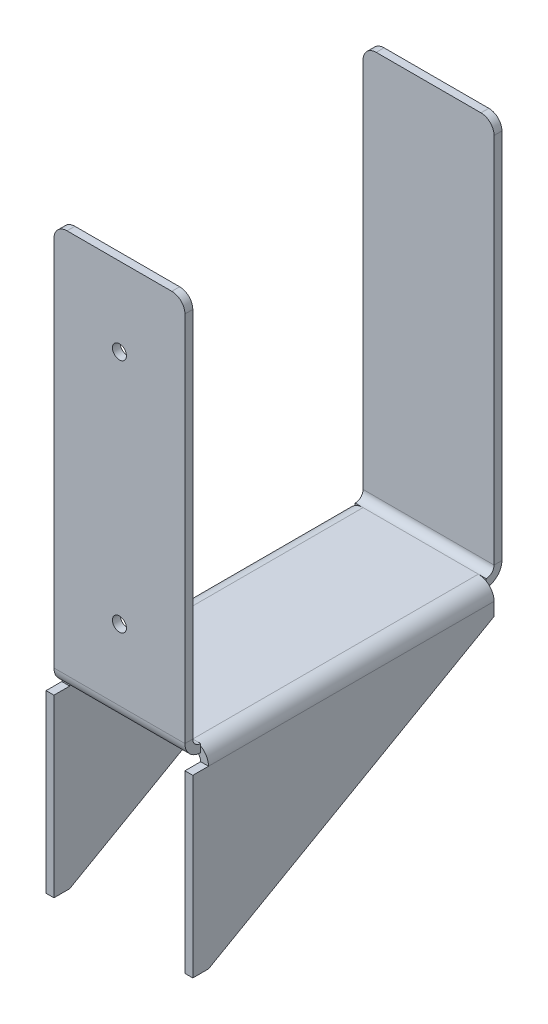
ISO-10303-21;
HEADER;
FILE_DESCRIPTION(('STEP AP214'),'2;1');
FILE_NAME('part.step','',(''),(''),'','','');
FILE_SCHEMA(('AUTOMOTIVE_DESIGN { 1 0 10303 214 1 1 1 1 }'));
ENDSEC;
DATA;
#1=APPLICATION_CONTEXT('core data for automotive mechanical design processes');
#2=APPLICATION_PROTOCOL_DEFINITION('international standard','automotive_design',2000,#1);
#3=PRODUCT_CONTEXT('',#1,'mechanical');
#4=PRODUCT('Part','Part','',(#3));
#5=PRODUCT_RELATED_PRODUCT_CATEGORY('part','',(#4));
#6=PRODUCT_DEFINITION_FORMATION('','',#4);
#7=PRODUCT_DEFINITION_CONTEXT('part definition',#1,'design');
#8=PRODUCT_DEFINITION('design','',#6,#7);
#9=PRODUCT_DEFINITION_SHAPE('','',#8);
#10=(LENGTH_UNIT() NAMED_UNIT(*) SI_UNIT(.MILLI.,.METRE.));
#11=(NAMED_UNIT(*) PLANE_ANGLE_UNIT() SI_UNIT($,.RADIAN.));
#12=(NAMED_UNIT(*) SI_UNIT($,.STERADIAN.) SOLID_ANGLE_UNIT());
#13=UNCERTAINTY_MEASURE_WITH_UNIT(LENGTH_MEASURE(1.E-05),#10,'distance_accuracy_value','');
#14=(GEOMETRIC_REPRESENTATION_CONTEXT(3) GLOBAL_UNCERTAINTY_ASSIGNED_CONTEXT((#13)) GLOBAL_UNIT_ASSIGNED_CONTEXT((#10,
#11,#12)) REPRESENTATION_CONTEXT('',''));
#15=CARTESIAN_POINT('',(0.,0.,0.));
#16=DIRECTION('',(0.,0.,1.));
#17=DIRECTION('',(1.,0.,0.));
#18=AXIS2_PLACEMENT_3D('',#15,#16,#17);
#19=CARTESIAN_POINT('',(53.,-3.00000000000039,-112.));
#20=DIRECTION('',(0.,0.,1.));
#21=DIRECTION('',(0.,-1.,0.));
#22=AXIS2_PLACEMENT_3D('',#19,#20,#21);
#23=PLANE('',#22);
#24=DIRECTION('',(-1.,0.,0.));
#25=VECTOR('',#24,1.);
#26=CARTESIAN_POINT('',(50.0000000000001,-11.0000000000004,-112.));
#27=LINE('',#26,#25);
#28=CARTESIAN_POINT('',(50.0000000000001,-11.0000000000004,-112.));
#29=VERTEX_POINT('',#28);
#30=CARTESIAN_POINT('',(53.,-11.0000000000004,-112.));
#31=VERTEX_POINT('',#30);
#32=EDGE_CURVE('E260',#29,#31,#27,.F.);
#33=ORIENTED_EDGE('',*,*,#32,.F.);
#34=DIRECTION('',(0.,1.,0.));
#35=VECTOR('',#34,1.);
#36=CARTESIAN_POINT('',(50.,-3.0000000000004,-112.));
#37=LINE('',#36,#35);
#38=CARTESIAN_POINT('',(50.,-6.00000000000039,-112.));
#39=VERTEX_POINT('',#38);
#40=EDGE_CURVE('E287',#29,#39,#37,.T.);
#41=ORIENTED_EDGE('',*,*,#40,.T.);
#42=DIRECTION('',(1.,0.,0.));
#43=VECTOR('',#42,1.);
#44=CARTESIAN_POINT('',(50.,-6.00000000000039,-112.));
#45=LINE('',#44,#43);
#46=CARTESIAN_POINT('',(53.,-6.00000000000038,-112.));
#47=VERTEX_POINT('',#46);
#48=EDGE_CURVE('E281',#39,#47,#45,.T.);
#49=ORIENTED_EDGE('',*,*,#48,.T.);
#50=DIRECTION('',(0.,1.,0.));
#51=VECTOR('',#50,1.);
#52=CARTESIAN_POINT('',(53.,-3.00000000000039,-112.));
#53=LINE('',#52,#51);
#54=EDGE_CURVE('E274',#31,#47,#53,.T.);
#55=ORIENTED_EDGE('',*,*,#54,.F.);
#56=EDGE_LOOP('',(#33,#41,#49,#55));
#57=FACE_BOUND('',#56,.T.);
#58=ADVANCED_FACE('F38',(#57),#23,.F.);
#59=CARTESIAN_POINT('',(53.0000000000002,-73.0000000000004,-112.));
#60=DIRECTION('',(-1.,0.,0.));
#61=DIRECTION('',(0.,-1.,0.));
#62=AXIS2_PLACEMENT_3D('',#59,#60,#61);
#63=PLANE('',#62);
#64=DIRECTION('',(0.,0.494420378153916,-0.869222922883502));
#65=VECTOR('',#64,1.);
#66=CARTESIAN_POINT('',(53.0000000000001,-26.1559936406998,-85.3547853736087));
#67=LINE('',#66,#65);
#68=CARTESIAN_POINT('',(53.0000000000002,-73.,-3.00000000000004));
#69=VERTEX_POINT('',#68);
#70=EDGE_CURVE('E56',#69,#31,#67,.T.);
#71=ORIENTED_EDGE('',*,*,#70,.T.);
#72=ORIENTED_EDGE('',*,*,#54,.T.);
#73=DIRECTION('',(0.,0.,-1.));
#74=VECTOR('',#73,1.);
#75=CARTESIAN_POINT('',(53.,-6.00000000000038,-112.));
#76=LINE('',#75,#74);
#77=CARTESIAN_POINT('',(53.0000000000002,-5.99999999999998,-2.99999999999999));
#78=VERTEX_POINT('',#77);
#79=EDGE_CURVE('E290',#78,#47,#76,.T.);
#80=ORIENTED_EDGE('',*,*,#79,.F.);
#81=DIRECTION('',(0.,0.,-1.));
#82=VECTOR('',#81,1.);
#83=CARTESIAN_POINT('',(53.0000000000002,-5.99999999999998,3.00000000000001));
#84=LINE('',#83,#82);
#85=CARTESIAN_POINT('',(53.0000000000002,-5.99999999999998,3.00000000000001));
#86=VERTEX_POINT('',#85);
#87=EDGE_CURVE('E589',#86,#78,#84,.T.);
#88=ORIENTED_EDGE('',*,*,#87,.F.);
#89=DIRECTION('',(0.,1.,0.));
#90=VECTOR('',#89,1.);
#91=CARTESIAN_POINT('',(53.0000000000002,-73.,3.00000000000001));
#92=LINE('',#91,#90);
#93=CARTESIAN_POINT('',(53.0000000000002,-73.,3.00000000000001));
#94=VERTEX_POINT('',#93);
#95=EDGE_CURVE('E595',#94,#86,#92,.T.);
#96=ORIENTED_EDGE('',*,*,#95,.F.);
#97=DIRECTION('',(0.,0.,-1.));
#98=VECTOR('',#97,1.);
#99=CARTESIAN_POINT('',(53.0000000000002,-73.0000000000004,-112.));
#100=LINE('',#99,#98);
#101=EDGE_CURVE('E277',#94,#69,#100,.T.);
#102=ORIENTED_EDGE('',*,*,#101,.T.);
#103=EDGE_LOOP('',(#71,#72,#80,#88,#96,#102));
#104=FACE_BOUND('',#103,.T.);
#105=ADVANCED_FACE('F272',(#104),#63,.F.);
#106=CARTESIAN_POINT('',(50.0000000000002,-73.0000000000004,-112.));
#107=DIRECTION('',(-1.,0.,0.));
#108=DIRECTION('',(0.,-1.,0.));
#109=AXIS2_PLACEMENT_3D('',#106,#107,#108);
#110=PLANE('',#109);
#111=ORIENTED_EDGE('',*,*,#40,.F.);
#112=DIRECTION('',(0.,0.494420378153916,-0.869222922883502));
#113=VECTOR('',#112,1.);
#114=CARTESIAN_POINT('',(50.0000000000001,-26.1559936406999,-85.3547853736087));
#115=LINE('',#114,#113);
#116=CARTESIAN_POINT('',(50.0000000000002,-73.,-3.00000000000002));
#117=VERTEX_POINT('',#116);
#118=EDGE_CURVE('E263',#117,#29,#115,.T.);
#119=ORIENTED_EDGE('',*,*,#118,.F.);
#120=DIRECTION('',(0.,0.,-1.));
#121=VECTOR('',#120,1.);
#122=CARTESIAN_POINT('',(50.0000000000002,-73.0000000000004,-112.));
#123=LINE('',#122,#121);
#124=CARTESIAN_POINT('',(50.,-73.,3.00000000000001));
#125=VERTEX_POINT('',#124);
#126=EDGE_CURVE('E282',#125,#117,#123,.T.);
#127=ORIENTED_EDGE('',*,*,#126,.F.);
#128=DIRECTION('',(0.,-1.,0.));
#129=VECTOR('',#128,1.);
#130=CARTESIAN_POINT('',(50.,-5.99999999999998,3.00000000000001));
#131=LINE('',#130,#129);
#132=CARTESIAN_POINT('',(50.,-5.99999999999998,3.00000000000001));
#133=VERTEX_POINT('',#132);
#134=EDGE_CURVE('E600',#133,#125,#131,.T.);
#135=ORIENTED_EDGE('',*,*,#134,.F.);
#136=DIRECTION('',(0.,0.,-1.));
#137=VECTOR('',#136,1.);
#138=CARTESIAN_POINT('',(50.,-5.99999999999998,3.00000000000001));
#139=LINE('',#138,#137);
#140=CARTESIAN_POINT('',(50.,-5.99999999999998,-2.99999999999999));
#141=VERTEX_POINT('',#140);
#142=EDGE_CURVE('E591',#133,#141,#139,.T.);
#143=ORIENTED_EDGE('',*,*,#142,.T.);
#144=DIRECTION('',(0.,0.,1.));
#145=VECTOR('',#144,1.);
#146=CARTESIAN_POINT('',(50.,-6.00000000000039,-112.));
#147=LINE('',#146,#145);
#148=EDGE_CURVE('E528',#39,#141,#147,.T.);
#149=ORIENTED_EDGE('',*,*,#148,.F.);
#150=EDGE_LOOP('',(#111,#119,#127,#135,#143,#149));
#151=FACE_BOUND('',#150,.T.);
#152=ADVANCED_FACE('F614',(#151),#110,.T.);
#153=CARTESIAN_POINT('',(53.0000000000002,-73.0000000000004,-112.));
#154=DIRECTION('',(0.,1.,0.));
#155=DIRECTION('',(0.,0.,1.));
#156=AXIS2_PLACEMENT_3D('',#153,#154,#155);
#157=PLANE('',#156);
#158=DIRECTION('',(-1.,0.,0.));
#159=VECTOR('',#158,1.);
#160=CARTESIAN_POINT('',(50.0000000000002,-73.,-3.00000000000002));
#161=LINE('',#160,#159);
#162=EDGE_CURVE('E268',#117,#69,#161,.F.);
#163=ORIENTED_EDGE('',*,*,#162,.T.);
#164=ORIENTED_EDGE('',*,*,#101,.F.);
#165=DIRECTION('',(1.,0.,0.));
#166=VECTOR('',#165,1.);
#167=CARTESIAN_POINT('',(50.,-73.,3.00000000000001));
#168=LINE('',#167,#166);
#169=EDGE_CURVE('E597',#125,#94,#168,.T.);
#170=ORIENTED_EDGE('',*,*,#169,.F.);
#171=ORIENTED_EDGE('',*,*,#126,.T.);
#172=EDGE_LOOP('',(#163,#164,#170,#171));
#173=FACE_BOUND('',#172,.T.);
#174=ADVANCED_FACE('F612',(#173),#157,.F.);
#175=CARTESIAN_POINT('',(-3.00000000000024,-73.0000000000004,-112.));
#176=DIRECTION('',(0.,0.,1.));
#177=DIRECTION('',(0.,-1.,0.));
#178=AXIS2_PLACEMENT_3D('',#175,#176,#177);
#179=PLANE('',#178);
#180=DIRECTION('',(-1.,0.,0.));
#181=VECTOR('',#180,1.);
#182=CARTESIAN_POINT('',(-3.00000000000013,-11.0000000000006,-112.));
#183=LINE('',#182,#181);
#184=CARTESIAN_POINT('',(-3.00000000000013,-11.0000000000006,-112.));
#185=VERTEX_POINT('',#184);
#186=CARTESIAN_POINT('',(0.,-11.0000000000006,-112.));
#187=VERTEX_POINT('',#186);
#188=EDGE_CURVE('E604',#185,#187,#183,.F.);
#189=ORIENTED_EDGE('',*,*,#188,.F.);
#190=DIRECTION('',(0.,-1.,0.));
#191=VECTOR('',#190,1.);
#192=CARTESIAN_POINT('',(-3.00000000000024,-73.0000000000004,-112.));
#193=LINE('',#192,#191);
#194=CARTESIAN_POINT('',(-3.00000000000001,-6.00000000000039,-112.));
#195=VERTEX_POINT('',#194);
#196=EDGE_CURVE('E555',#195,#185,#193,.T.);
#197=ORIENTED_EDGE('',*,*,#196,.F.);
#198=DIRECTION('',(-1.,0.,0.));
#199=VECTOR('',#198,1.);
#200=CARTESIAN_POINT('',(0.,-6.00000000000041,-112.));
#201=LINE('',#200,#199);
#202=CARTESIAN_POINT('',(0.,-6.00000000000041,-112.));
#203=VERTEX_POINT('',#202);
#204=EDGE_CURVE('E565',#203,#195,#201,.T.);
#205=ORIENTED_EDGE('',*,*,#204,.F.);
#206=DIRECTION('',(0.,-1.,0.));
#207=VECTOR('',#206,1.);
#208=CARTESIAN_POINT('',(-2.3746494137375E-13,-73.0000000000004,-112.));
#209=LINE('',#208,#207);
#210=EDGE_CURVE('E556',#203,#187,#209,.T.);
#211=ORIENTED_EDGE('',*,*,#210,.T.);
#212=EDGE_LOOP('',(#189,#197,#205,#211));
#213=FACE_BOUND('',#212,.T.);
#214=ADVANCED_FACE('F809',(#213),#179,.F.);
#215=CARTESIAN_POINT('',(-3.00000000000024,-73.,-2.99999999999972));
#216=DIRECTION('',(1.,0.,0.));
#217=DIRECTION('',(0.,1.,0.));
#218=AXIS2_PLACEMENT_3D('',#215,#216,#217);
#219=PLANE('',#218);
#220=DIRECTION('',(0.,-0.494420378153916,0.869222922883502));
#221=VECTOR('',#220,1.);
#222=CARTESIAN_POINT('',(-3.00000000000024,-73.0000000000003,-2.99999999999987));
#223=LINE('',#222,#221);
#224=CARTESIAN_POINT('',(-3.00000000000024,-73.,-3.00000000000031));
#225=VERTEX_POINT('',#224);
#226=EDGE_CURVE('E267',#185,#225,#223,.T.);
#227=ORIENTED_EDGE('',*,*,#226,.T.);
#228=DIRECTION('',(0.,0.,1.));
#229=VECTOR('',#228,1.);
#230=CARTESIAN_POINT('',(-3.00000000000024,-73.,-2.99999999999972));
#231=LINE('',#230,#229);
#232=CARTESIAN_POINT('',(-3.00000000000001,-73.,3.00000000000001));
#233=VERTEX_POINT('',#232);
#234=EDGE_CURVE('E540',#225,#233,#231,.T.);
#235=ORIENTED_EDGE('',*,*,#234,.T.);
#236=DIRECTION('',(0.,-1.,0.));
#237=VECTOR('',#236,1.);
#238=CARTESIAN_POINT('',(-3.00000000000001,-5.99999999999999,3.00000000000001));
#239=LINE('',#238,#237);
#240=CARTESIAN_POINT('',(-3.00000000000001,-5.99999999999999,3.00000000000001));
#241=VERTEX_POINT('',#240);
#242=EDGE_CURVE('E586',#241,#233,#239,.T.);
#243=ORIENTED_EDGE('',*,*,#242,.F.);
#244=DIRECTION('',(0.,0.,-1.));
#245=VECTOR('',#244,1.);
#246=CARTESIAN_POINT('',(-3.00000000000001,-5.99999999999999,3.00000000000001));
#247=LINE('',#246,#245);
#248=CARTESIAN_POINT('',(-3.00000000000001,-5.99999999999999,-2.99999999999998));
#249=VERTEX_POINT('',#248);
#250=EDGE_CURVE('E576',#241,#249,#247,.T.);
#251=ORIENTED_EDGE('',*,*,#250,.T.);
#252=DIRECTION('',(0.,0.,1.));
#253=VECTOR('',#252,1.);
#254=CARTESIAN_POINT('',(-3.00000000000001,-5.99999999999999,-2.99999999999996));
#255=LINE('',#254,#253);
#256=EDGE_CURVE('E559',#195,#249,#255,.T.);
#257=ORIENTED_EDGE('',*,*,#256,.F.);
#258=ORIENTED_EDGE('',*,*,#196,.T.);
#259=EDGE_LOOP('',(#227,#235,#243,#251,#257,#258));
#260=FACE_BOUND('',#259,.T.);
#261=ADVANCED_FACE('F823',(#260),#219,.F.);
#262=CARTESIAN_POINT('',(-2.44403835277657E-13,-73.,-2.99999999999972));
#263=DIRECTION('',(1.,0.,0.));
#264=DIRECTION('',(0.,1.,0.));
#265=AXIS2_PLACEMENT_3D('',#262,#263,#264);
#266=PLANE('',#265);
#267=DIRECTION('',(0.,0.,1.));
#268=VECTOR('',#267,1.);
#269=CARTESIAN_POINT('',(-2.44403835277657E-13,-73.,-2.99999999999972));
#270=LINE('',#269,#268);
#271=CARTESIAN_POINT('',(-2.44403835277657E-13,-73.,-3.00000000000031));
#272=VERTEX_POINT('',#271);
#273=CARTESIAN_POINT('',(-2.44403835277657E-13,-73.,3.00000000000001));
#274=VERTEX_POINT('',#273);
#275=EDGE_CURVE('E553',#272,#274,#270,.T.);
#276=ORIENTED_EDGE('',*,*,#275,.F.);
#277=DIRECTION('',(0.,-0.494420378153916,0.869222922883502));
#278=VECTOR('',#277,1.);
#279=CARTESIAN_POINT('',(-2.4459601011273E-13,-73.0000000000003,-2.99999999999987));
#280=LINE('',#279,#278);
#281=EDGE_CURVE('E64',#187,#272,#280,.T.);
#282=ORIENTED_EDGE('',*,*,#281,.F.);
#283=ORIENTED_EDGE('',*,*,#210,.F.);
#284=DIRECTION('',(0.,0.,-1.));
#285=VECTOR('',#284,1.);
#286=CARTESIAN_POINT('',(0.,-6.,-2.99999999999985));
#287=LINE('',#286,#285);
#288=CARTESIAN_POINT('',(0.,-6.,-2.99999999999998));
#289=VERTEX_POINT('',#288);
#290=EDGE_CURVE('E569',#289,#203,#287,.T.);
#291=ORIENTED_EDGE('',*,*,#290,.F.);
#292=DIRECTION('',(0.,0.,-1.));
#293=VECTOR('',#292,1.);
#294=CARTESIAN_POINT('',(-2.44403835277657E-13,-5.99999999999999,3.00000000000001));
#295=LINE('',#294,#293);
#296=CARTESIAN_POINT('',(-2.44403835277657E-13,-5.99999999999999,3.00000000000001));
#297=VERTEX_POINT('',#296);
#298=EDGE_CURVE('E570',#297,#289,#295,.T.);
#299=ORIENTED_EDGE('',*,*,#298,.F.);
#300=DIRECTION('',(0.,1.,0.));
#301=VECTOR('',#300,1.);
#302=CARTESIAN_POINT('',(-2.44403835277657E-13,-73.,3.00000000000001));
#303=LINE('',#302,#301);
#304=EDGE_CURVE('E581',#274,#297,#303,.T.);
#305=ORIENTED_EDGE('',*,*,#304,.F.);
#306=EDGE_LOOP('',(#276,#282,#283,#291,#299,#305));
#307=FACE_BOUND('',#306,.T.);
#308=ADVANCED_FACE('F812',(#307),#266,.T.);
#309=CARTESIAN_POINT('',(-3.00000000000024,-73.,-2.99999999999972));
#310=DIRECTION('',(0.,1.,0.));
#311=DIRECTION('',(0.,0.,1.));
#312=AXIS2_PLACEMENT_3D('',#309,#310,#311);
#313=PLANE('',#312);
#314=DIRECTION('',(-1.,0.,0.));
#315=VECTOR('',#314,1.);
#316=CARTESIAN_POINT('',(-3.00000000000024,-73.,-3.00000000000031));
#317=LINE('',#316,#315);
#318=EDGE_CURVE('E603',#225,#272,#317,.F.);
#319=ORIENTED_EDGE('',*,*,#318,.T.);
#320=ORIENTED_EDGE('',*,*,#275,.T.);
#321=DIRECTION('',(1.,0.,0.));
#322=VECTOR('',#321,1.);
#323=CARTESIAN_POINT('',(-3.00000000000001,-73.,3.00000000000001));
#324=LINE('',#323,#322);
#325=EDGE_CURVE('E583',#233,#274,#324,.T.);
#326=ORIENTED_EDGE('',*,*,#325,.F.);
#327=ORIENTED_EDGE('',*,*,#234,.F.);
#328=EDGE_LOOP('',(#319,#320,#326,#327));
#329=FACE_BOUND('',#328,.T.);
#330=ADVANCED_FACE('F671',(#329),#313,.F.);
#331=CARTESIAN_POINT('',(0.,-3.00000000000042,-112.));
#332=DIRECTION('',(0.,0.,1.));
#333=DIRECTION('',(1.,0.,0.));
#334=AXIS2_PLACEMENT_3D('',#331,#332,#333);
#335=PLANE('',#334);
#336=DIRECTION('',(0.,-1.,0.));
#337=VECTOR('',#336,1.);
#338=CARTESIAN_POINT('',(0.,-4.22838847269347E-13,-112.));
#339=LINE('',#338,#337);
#340=CARTESIAN_POINT('',(0.,-4.23272528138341E-13,-112.));
#341=VERTEX_POINT('',#340);
#342=CARTESIAN_POINT('',(0.,-0.803847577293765,-112.));
#343=VERTEX_POINT('',#342);
#344=EDGE_CURVE('E377',#341,#343,#339,.T.);
#345=ORIENTED_EDGE('',*,*,#344,.T.);
#346=CARTESIAN_POINT('',(3.00000000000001,-6.00000000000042,-112.));
#347=DIRECTION('',(0.,0.,-1.));
#348=DIRECTION('',(0.,1.,0.));
#349=AXIS2_PLACEMENT_3D('',#346,#347,#348);
#350=CIRCLE('',#349,6.00000000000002);
#351=CARTESIAN_POINT('',(3.00000000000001,-3.98986399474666E-13,-112.));
#352=VERTEX_POINT('',#351);
#353=EDGE_CURVE('E11',#343,#352,#350,.T.);
#354=ORIENTED_EDGE('',*,*,#353,.T.);
#355=DIRECTION('',(-1.,0.,0.));
#356=VECTOR('',#355,1.);
#357=CARTESIAN_POINT('',(0.,-4.22838847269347E-13,-112.));
#358=LINE('',#357,#356);
#359=EDGE_CURVE('E365',#341,#352,#358,.F.);
#360=ORIENTED_EDGE('',*,*,#359,.F.);
#361=EDGE_LOOP('',(#345,#354,#360));
#362=FACE_BOUND('',#361,.T.);
#363=ADVANCED_FACE('F667',(#362),#335,.T.);
#364=CARTESIAN_POINT('',(3.00000000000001,-2.99999999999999,-2.99999999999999));
#365=DIRECTION('',(0.,0.,-1.));
#366=DIRECTION('',(0.,1.,0.));
#367=AXIS2_PLACEMENT_3D('',#364,#365,#366);
#368=PLANE('',#367);
#369=DIRECTION('',(-1.,0.,0.));
#370=VECTOR('',#369,1.);
#371=CARTESIAN_POINT('',(50.,0.,-2.99999999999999));
#372=LINE('',#371,#370);
#373=CARTESIAN_POINT('',(3.00000000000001,0.,-3.));
#374=VERTEX_POINT('',#373);
#375=CARTESIAN_POINT('',(0.,0.,-2.99999999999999));
#376=VERTEX_POINT('',#375);
#377=EDGE_CURVE('E385',#374,#376,#372,.T.);
#378=ORIENTED_EDGE('',*,*,#377,.F.);
#379=CARTESIAN_POINT('',(3.00000000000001,-6.00000000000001,-2.99999999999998));
#380=DIRECTION('',(0.,0.,-1.));
#381=DIRECTION('',(0.,1.,0.));
#382=AXIS2_PLACEMENT_3D('',#379,#380,#381);
#383=CIRCLE('',#382,6.00000000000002);
#384=CARTESIAN_POINT('',(0.,-0.80384757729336,-2.99999999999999));
#385=VERTEX_POINT('',#384);
#386=EDGE_CURVE('E534',#374,#385,#383,.F.);
#387=ORIENTED_EDGE('',*,*,#386,.T.);
#388=DIRECTION('',(0.,-1.,0.));
#389=VECTOR('',#388,1.);
#390=CARTESIAN_POINT('',(0.,0.,-2.99999999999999));
#391=LINE('',#390,#389);
#392=EDGE_CURVE('E386',#376,#385,#391,.T.);
#393=ORIENTED_EDGE('',*,*,#392,.F.);
#394=EDGE_LOOP('',(#378,#387,#393));
#395=FACE_BOUND('',#394,.T.);
#396=ADVANCED_FACE('F663',(#395),#368,.T.);
#397=CARTESIAN_POINT('',(47.,-3.00000000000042,-112.));
#398=DIRECTION('',(0.,0.,1.));
#399=DIRECTION('',(1.,0.,0.));
#400=AXIS2_PLACEMENT_3D('',#397,#398,#399);
#401=PLANE('',#400);
#402=CARTESIAN_POINT('',(47.,-4.23272528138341E-13,-112.));
#403=VERTEX_POINT('',#402);
#404=CARTESIAN_POINT('',(50.,-4.22838847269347E-13,-112.));
#405=VERTEX_POINT('',#404);
#406=EDGE_CURVE('E369',#403,#405,#358,.F.);
#407=ORIENTED_EDGE('',*,*,#406,.F.);
#408=CARTESIAN_POINT('',(47.,-6.0000000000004,-112.));
#409=DIRECTION('',(0.,0.,1.));
#410=DIRECTION('',(0.,-1.,0.));
#411=AXIS2_PLACEMENT_3D('',#408,#409,#410);
#412=CIRCLE('',#411,5.99999999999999);
#413=CARTESIAN_POINT('',(50.,-0.803847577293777,-112.));
#414=VERTEX_POINT('',#413);
#415=EDGE_CURVE('E299',#403,#414,#412,.F.);
#416=ORIENTED_EDGE('',*,*,#415,.T.);
#417=DIRECTION('',(0.,-1.,0.));
#418=VECTOR('',#417,1.);
#419=CARTESIAN_POINT('',(50.,-4.22838847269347E-13,-112.));
#420=LINE('',#419,#418);
#421=EDGE_CURVE('E372',#405,#414,#420,.T.);
#422=ORIENTED_EDGE('',*,*,#421,.F.);
#423=EDGE_LOOP('',(#407,#416,#422));
#424=FACE_BOUND('',#423,.T.);
#425=ADVANCED_FACE('F666',(#424),#401,.T.);
#426=CARTESIAN_POINT('',(50.,-3.00000000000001,-2.99999999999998));
#427=DIRECTION('',(0.,0.,-1.));
#428=DIRECTION('',(-1.,0.,0.));
#429=AXIS2_PLACEMENT_3D('',#426,#427,#428);
#430=PLANE('',#429);
#431=DIRECTION('',(0.,-1.,0.));
#432=VECTOR('',#431,1.);
#433=CARTESIAN_POINT('',(50.,0.,-2.99999999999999));
#434=LINE('',#433,#432);
#435=CARTESIAN_POINT('',(50.,0.,-2.99999999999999));
#436=VERTEX_POINT('',#435);
#437=CARTESIAN_POINT('',(50.,-0.803847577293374,-2.99999999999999));
#438=VERTEX_POINT('',#437);
#439=EDGE_CURVE('E390',#436,#438,#434,.T.);
#440=ORIENTED_EDGE('',*,*,#439,.T.);
#441=CARTESIAN_POINT('',(47.,-5.99999999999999,-2.99999999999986));
#442=DIRECTION('',(0.,0.,1.));
#443=DIRECTION('',(0.,-1.,0.));
#444=AXIS2_PLACEMENT_3D('',#441,#442,#443);
#445=CIRCLE('',#444,5.99999999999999);
#446=CARTESIAN_POINT('',(47.,0.,-2.99999999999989));
#447=VERTEX_POINT('',#446);
#448=EDGE_CURVE('E47',#438,#447,#445,.T.);
#449=ORIENTED_EDGE('',*,*,#448,.T.);
#450=EDGE_CURVE('E380',#436,#447,#372,.T.);
#451=ORIENTED_EDGE('',*,*,#450,.F.);
#452=EDGE_LOOP('',(#440,#449,#451));
#453=FACE_BOUND('',#452,.T.);
#454=ADVANCED_FACE('F675',(#453),#430,.T.);
#455=CARTESIAN_POINT('',(0.,-3.,0.));
#456=DIRECTION('',(0.,1.,0.));
#457=DIRECTION('',(0.,0.,1.));
#458=AXIS2_PLACEMENT_3D('',#455,#456,#457);
#459=PLANE('',#458);
#460=DIRECTION('',(0.,0.,-1.));
#461=VECTOR('',#460,1.);
#462=CARTESIAN_POINT('',(3.00000000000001,-3.0000000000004,-112.));
#463=LINE('',#462,#461);
#464=CARTESIAN_POINT('',(3.00000000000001,-3.0000000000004,-112.));
#465=VERTEX_POINT('',#464);
#466=CARTESIAN_POINT('',(3.00000000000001,-2.99999999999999,-2.99999999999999));
#467=VERTEX_POINT('',#466);
#468=EDGE_CURVE('E539',#465,#467,#463,.F.);
#469=ORIENTED_EDGE('',*,*,#468,.F.);
#470=DIRECTION('',(-1.,0.,0.));
#471=VECTOR('',#470,1.);
#472=CARTESIAN_POINT('',(0.,-3.00000000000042,-112.));
#473=LINE('',#472,#471);
#474=CARTESIAN_POINT('',(47.,-3.00000000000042,-112.));
#475=VERTEX_POINT('',#474);
#476=EDGE_CURVE('E355',#465,#475,#473,.F.);
#477=ORIENTED_EDGE('',*,*,#476,.T.);
#478=DIRECTION('',(0.,0.,1.));
#479=VECTOR('',#478,1.);
#480=CARTESIAN_POINT('',(47.,-3.00000000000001,-2.99999999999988));
#481=LINE('',#480,#479);
#482=CARTESIAN_POINT('',(47.,-3.00000000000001,-2.99999999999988));
#483=VERTEX_POINT('',#482);
#484=EDGE_CURVE('E307',#483,#475,#481,.F.);
#485=ORIENTED_EDGE('',*,*,#484,.F.);
#486=DIRECTION('',(1.,0.,0.));
#487=VECTOR('',#486,1.);
#488=CARTESIAN_POINT('',(0.,-3.00000000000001,-2.99999999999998));
#489=LINE('',#488,#487);
#490=EDGE_CURVE('E389',#467,#483,#489,.T.);
#491=ORIENTED_EDGE('',*,*,#490,.F.);
#492=EDGE_LOOP('',(#469,#477,#485,#491));
#493=FACE_BOUND('',#492,.T.);
#494=ADVANCED_FACE('F679',(#493),#459,.F.);
#495=CARTESIAN_POINT('',(0.,0.,0.));
#496=DIRECTION('',(0.,1.,0.));
#497=DIRECTION('',(0.,0.,1.));
#498=AXIS2_PLACEMENT_3D('',#495,#496,#497);
#499=PLANE('',#498);
#500=EDGE_CURVE('E368',#352,#403,#358,.F.);
#501=ORIENTED_EDGE('',*,*,#500,.F.);
#502=DIRECTION('',(0.,0.,-1.));
#503=VECTOR('',#502,1.);
#504=CARTESIAN_POINT('',(3.00000000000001,-3.98986399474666E-13,-112.));
#505=LINE('',#504,#503);
#506=EDGE_CURVE('E547',#352,#374,#505,.F.);
#507=ORIENTED_EDGE('',*,*,#506,.T.);
#508=EDGE_CURVE('E384',#447,#374,#372,.T.);
#509=ORIENTED_EDGE('',*,*,#508,.F.);
#510=DIRECTION('',(0.,0.,1.));
#511=VECTOR('',#510,1.);
#512=CARTESIAN_POINT('',(47.,0.,-2.99999999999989));
#513=LINE('',#512,#511);
#514=EDGE_CURVE('E294',#447,#403,#513,.F.);
#515=ORIENTED_EDGE('',*,*,#514,.T.);
#516=EDGE_LOOP('',(#501,#507,#509,#515));
#517=FACE_BOUND('',#516,.T.);
#518=ADVANCED_FACE('F725',(#517),#499,.T.);
#519=CARTESIAN_POINT('',(0.,0.,3.));
#520=DIRECTION('',(1.,0.,0.));
#521=DIRECTION('',(0.,0.,-1.));
#522=AXIS2_PLACEMENT_3D('',#519,#520,#521);
#523=PLANE('',#522);
#524=DIRECTION('',(0.,-1.,0.));
#525=VECTOR('',#524,1.);
#526=CARTESIAN_POINT('',(0.,0.,3.));
#527=LINE('',#526,#525);
#528=CARTESIAN_POINT('',(0.,145.,3.));
#529=VERTEX_POINT('',#528);
#530=CARTESIAN_POINT('',(0.,2.99999999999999,3.));
#531=VERTEX_POINT('',#530);
#532=EDGE_CURVE('E420',#529,#531,#527,.T.);
#533=ORIENTED_EDGE('',*,*,#532,.F.);
#534=DIRECTION('',(0.,0.,-1.));
#535=VECTOR('',#534,1.);
#536=CARTESIAN_POINT('',(0.,145.,3.));
#537=LINE('',#536,#535);
#538=CARTESIAN_POINT('',(0.,145.,0.));
#539=VERTEX_POINT('',#538);
#540=EDGE_CURVE('E429',#529,#539,#537,.T.);
#541=ORIENTED_EDGE('',*,*,#540,.T.);
#542=DIRECTION('',(0.,-1.,0.));
#543=VECTOR('',#542,1.);
#544=CARTESIAN_POINT('',(0.,0.,0.));
#545=LINE('',#544,#543);
#546=CARTESIAN_POINT('',(0.,3.,0.));
#547=VERTEX_POINT('',#546);
#548=EDGE_CURVE('E417',#539,#547,#545,.T.);
#549=ORIENTED_EDGE('',*,*,#548,.T.);
#550=DIRECTION('',(0.,0.,1.));
#551=VECTOR('',#550,1.);
#552=CARTESIAN_POINT('',(0.,2.99999999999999,0.));
#553=LINE('',#552,#551);
#554=EDGE_CURVE('E403',#547,#531,#553,.T.);
#555=ORIENTED_EDGE('',*,*,#554,.T.);
#556=EDGE_LOOP('',(#533,#541,#549,#555));
#557=FACE_BOUND('',#556,.T.);
#558=ADVANCED_FACE('F490',(#557),#523,.F.);
#559=CARTESIAN_POINT('',(50.,0.,3.));
#560=DIRECTION('',(-1.,0.,0.));
#561=DIRECTION('',(0.,0.,1.));
#562=AXIS2_PLACEMENT_3D('',#559,#560,#561);
#563=PLANE('',#562);
#564=DIRECTION('',(0.,1.,0.));
#565=VECTOR('',#564,1.);
#566=CARTESIAN_POINT('',(50.,0.,0.));
#567=LINE('',#566,#565);
#568=CARTESIAN_POINT('',(50.,2.99999999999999,0.));
#569=VERTEX_POINT('',#568);
#570=CARTESIAN_POINT('',(50.,145.,0.));
#571=VERTEX_POINT('',#570);
#572=EDGE_CURVE('E431',#569,#571,#567,.T.);
#573=ORIENTED_EDGE('',*,*,#572,.T.);
#574=DIRECTION('',(0.,0.,-1.));
#575=VECTOR('',#574,1.);
#576=CARTESIAN_POINT('',(50.,145.,3.));
#577=LINE('',#576,#575);
#578=CARTESIAN_POINT('',(50.,145.,3.));
#579=VERTEX_POINT('',#578);
#580=EDGE_CURVE('E451',#571,#579,#577,.F.);
#581=ORIENTED_EDGE('',*,*,#580,.T.);
#582=DIRECTION('',(0.,1.,0.));
#583=VECTOR('',#582,1.);
#584=CARTESIAN_POINT('',(50.,0.,3.));
#585=LINE('',#584,#583);
#586=CARTESIAN_POINT('',(50.,2.99999999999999,3.));
#587=VERTEX_POINT('',#586);
#588=EDGE_CURVE('E422',#587,#579,#585,.T.);
#589=ORIENTED_EDGE('',*,*,#588,.F.);
#590=DIRECTION('',(0.,0.,1.));
#591=VECTOR('',#590,1.);
#592=CARTESIAN_POINT('',(50.,2.99999999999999,0.));
#593=LINE('',#592,#591);
#594=EDGE_CURVE('E414',#569,#587,#593,.T.);
#595=ORIENTED_EDGE('',*,*,#594,.F.);
#596=EDGE_LOOP('',(#573,#581,#589,#595));
#597=FACE_BOUND('',#596,.T.);
#598=ADVANCED_FACE('F507',(#597),#563,.F.);
#599=CARTESIAN_POINT('',(0.,150.,3.));
#600=DIRECTION('',(0.,0.,-1.));
#601=DIRECTION('',(-1.,0.,0.));
#602=AXIS2_PLACEMENT_3D('',#599,#600,#601);
#603=PLANE('',#602);
#604=CARTESIAN_POINT('',(25.,30.,3.));
#605=DIRECTION('',(0.,0.,1.));
#606=DIRECTION('',(1.,0.,0.));
#607=AXIS2_PLACEMENT_3D('',#604,#605,#606);
#608=CIRCLE('',#607,2.675);
#609=CARTESIAN_POINT('',(27.675,30.,3.));
#610=VERTEX_POINT('',#609);
#611=EDGE_CURVE('E315',#610,#610,#608,.T.);
#612=ORIENTED_EDGE('',*,*,#611,.F.);
#613=EDGE_LOOP('',(#612));
#614=FACE_BOUND('',#613,.T.);
#615=CARTESIAN_POINT('',(25.,120.,3.));
#616=DIRECTION('',(0.,0.,1.));
#617=DIRECTION('',(1.,0.,0.));
#618=AXIS2_PLACEMENT_3D('',#615,#616,#617);
#619=CIRCLE('',#618,2.675);
#620=CARTESIAN_POINT('',(27.675,120.,3.));
#621=VERTEX_POINT('',#620);
#622=EDGE_CURVE('E320',#621,#621,#619,.T.);
#623=ORIENTED_EDGE('',*,*,#622,.F.);
#624=EDGE_LOOP('',(#623));
#625=FACE_BOUND('',#624,.T.);
#626=DIRECTION('',(-1.,0.,0.));
#627=VECTOR('',#626,1.);
#628=CARTESIAN_POINT('',(0.,150.,3.));
#629=LINE('',#628,#627);
#630=CARTESIAN_POINT('',(45.,150.,3.));
#631=VERTEX_POINT('',#630);
#632=CARTESIAN_POINT('',(5.,150.,3.));
#633=VERTEX_POINT('',#632);
#634=EDGE_CURVE('E426',#631,#633,#629,.T.);
#635=ORIENTED_EDGE('',*,*,#634,.T.);
#636=CARTESIAN_POINT('',(5.,145.,3.));
#637=DIRECTION('',(0.,0.,-1.));
#638=DIRECTION('',(-1.,0.,0.));
#639=AXIS2_PLACEMENT_3D('',#636,#637,#638);
#640=CIRCLE('',#639,5.);
#641=EDGE_CURVE('E449',#633,#529,#640,.F.);
#642=ORIENTED_EDGE('',*,*,#641,.T.);
#643=ORIENTED_EDGE('',*,*,#532,.T.);
#644=DIRECTION('',(-1.,0.,0.));
#645=VECTOR('',#644,1.);
#646=CARTESIAN_POINT('',(0.,2.99999999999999,3.));
#647=LINE('',#646,#645);
#648=EDGE_CURVE('E397',#531,#587,#647,.F.);
#649=ORIENTED_EDGE('',*,*,#648,.T.);
#650=ORIENTED_EDGE('',*,*,#588,.T.);
#651=CARTESIAN_POINT('',(45.,145.,3.));
#652=DIRECTION('',(0.,0.,-1.));
#653=DIRECTION('',(-1.,0.,0.));
#654=AXIS2_PLACEMENT_3D('',#651,#652,#653);
#655=CIRCLE('',#654,5.);
#656=EDGE_CURVE('E447',#579,#631,#655,.F.);
#657=ORIENTED_EDGE('',*,*,#656,.T.);
#658=EDGE_LOOP('',(#635,#642,#643,#649,#650,#657));
#659=FACE_BOUND('',#658,.T.);
#660=ADVANCED_FACE('F480',(#614,#625,#659),#603,.F.);
#661=CARTESIAN_POINT('',(0.,150.,0.));
#662=DIRECTION('',(0.,0.,-1.));
#663=DIRECTION('',(-1.,0.,0.));
#664=AXIS2_PLACEMENT_3D('',#661,#662,#663);
#665=PLANE('',#664);
#666=CARTESIAN_POINT('',(25.,30.,0.));
#667=DIRECTION('',(0.,0.,-1.));
#668=DIRECTION('',(-1.,0.,0.));
#669=AXIS2_PLACEMENT_3D('',#666,#667,#668);
#670=CIRCLE('',#669,2.675);
#671=CARTESIAN_POINT('',(22.325,30.,0.));
#672=VERTEX_POINT('',#671);
#673=EDGE_CURVE('E42',#672,#672,#670,.T.);
#674=ORIENTED_EDGE('',*,*,#673,.F.);
#675=EDGE_LOOP('',(#674));
#676=FACE_BOUND('',#675,.T.);
#677=CARTESIAN_POINT('',(25.,120.,0.));
#678=DIRECTION('',(0.,0.,-1.));
#679=DIRECTION('',(-1.,0.,0.));
#680=AXIS2_PLACEMENT_3D('',#677,#678,#679);
#681=CIRCLE('',#680,2.675);
#682=CARTESIAN_POINT('',(22.325,120.,0.));
#683=VERTEX_POINT('',#682);
#684=EDGE_CURVE('E323',#683,#683,#681,.T.);
#685=ORIENTED_EDGE('',*,*,#684,.F.);
#686=EDGE_LOOP('',(#685));
#687=FACE_BOUND('',#686,.T.);
#688=ORIENTED_EDGE('',*,*,#548,.F.);
#689=CARTESIAN_POINT('',(5.,145.,0.));
#690=DIRECTION('',(0.,0.,-1.));
#691=DIRECTION('',(-1.,0.,0.));
#692=AXIS2_PLACEMENT_3D('',#689,#690,#691);
#693=CIRCLE('',#692,5.);
#694=CARTESIAN_POINT('',(5.,150.,0.));
#695=VERTEX_POINT('',#694);
#696=EDGE_CURVE('E440',#539,#695,#693,.T.);
#697=ORIENTED_EDGE('',*,*,#696,.T.);
#698=DIRECTION('',(-1.,0.,0.));
#699=VECTOR('',#698,1.);
#700=CARTESIAN_POINT('',(0.,150.,0.));
#701=LINE('',#700,#699);
#702=CARTESIAN_POINT('',(45.,150.,0.));
#703=VERTEX_POINT('',#702);
#704=EDGE_CURVE('E423',#703,#695,#701,.T.);
#705=ORIENTED_EDGE('',*,*,#704,.F.);
#706=CARTESIAN_POINT('',(45.,145.,0.));
#707=DIRECTION('',(0.,0.,-1.));
#708=DIRECTION('',(-1.,0.,0.));
#709=AXIS2_PLACEMENT_3D('',#706,#707,#708);
#710=CIRCLE('',#709,5.);
#711=EDGE_CURVE('E438',#703,#571,#710,.T.);
#712=ORIENTED_EDGE('',*,*,#711,.T.);
#713=ORIENTED_EDGE('',*,*,#572,.F.);
#714=DIRECTION('',(-1.,0.,0.));
#715=VECTOR('',#714,1.);
#716=CARTESIAN_POINT('',(0.,2.99999999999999,0.));
#717=LINE('',#716,#715);
#718=EDGE_CURVE('E409',#547,#569,#717,.F.);
#719=ORIENTED_EDGE('',*,*,#718,.F.);
#720=EDGE_LOOP('',(#688,#697,#705,#712,#713,#719));
#721=FACE_BOUND('',#720,.T.);
#722=ADVANCED_FACE('F476',(#676,#687,#721),#665,.T.);
#723=CARTESIAN_POINT('',(0.,150.,3.));
#724=DIRECTION('',(0.,-1.,0.));
#725=DIRECTION('',(0.,0.,-1.));
#726=AXIS2_PLACEMENT_3D('',#723,#724,#725);
#727=PLANE('',#726);
#728=ORIENTED_EDGE('',*,*,#704,.T.);
#729=DIRECTION('',(0.,0.,-1.));
#730=VECTOR('',#729,1.);
#731=CARTESIAN_POINT('',(5.,150.,3.));
#732=LINE('',#731,#730);
#733=EDGE_CURVE('E445',#695,#633,#732,.F.);
#734=ORIENTED_EDGE('',*,*,#733,.T.);
#735=ORIENTED_EDGE('',*,*,#634,.F.);
#736=DIRECTION('',(0.,0.,-1.));
#737=VECTOR('',#736,1.);
#738=CARTESIAN_POINT('',(45.,150.,3.));
#739=LINE('',#738,#737);
#740=EDGE_CURVE('E442',#631,#703,#739,.T.);
#741=ORIENTED_EDGE('',*,*,#740,.T.);
#742=EDGE_LOOP('',(#728,#734,#735,#741));
#743=FACE_BOUND('',#742,.T.);
#744=ADVANCED_FACE('F479',(#743),#727,.F.);
#745=CARTESIAN_POINT('',(50.,2.99999999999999,-3.));
#746=DIRECTION('',(1.,0.,0.));
#747=DIRECTION('',(0.,0.,-1.));
#748=AXIS2_PLACEMENT_3D('',#745,#746,#747);
#749=PLANE('',#748);
#750=ORIENTED_EDGE('',*,*,#439,.F.);
#751=CARTESIAN_POINT('',(50.,2.99999999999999,-3.));
#752=DIRECTION('',(-1.,0.,0.));
#753=DIRECTION('',(0.,0.,1.));
#754=AXIS2_PLACEMENT_3D('',#751,#752,#753);
#755=CIRCLE('',#754,3.);
#756=EDGE_CURVE('E406',#569,#436,#755,.F.);
#757=ORIENTED_EDGE('',*,*,#756,.F.);
#758=ORIENTED_EDGE('',*,*,#594,.T.);
#759=CARTESIAN_POINT('',(50.,2.99999999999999,-3.));
#760=DIRECTION('',(-1.,0.,0.));
#761=DIRECTION('',(0.,0.,1.));
#762=AXIS2_PLACEMENT_3D('',#759,#760,#761);
#763=CIRCLE('',#762,6.);
#764=CARTESIAN_POINT('',(50.,-3.00000000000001,-2.99999999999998));
#765=VERTEX_POINT('',#764);
#766=EDGE_CURVE('E399',#587,#765,#763,.F.);
#767=ORIENTED_EDGE('',*,*,#766,.T.);
#768=EDGE_CURVE('E375',#438,#765,#434,.T.);
#769=ORIENTED_EDGE('',*,*,#768,.F.);
#770=EDGE_LOOP('',(#750,#757,#758,#767,#769));
#771=FACE_BOUND('',#770,.T.);
#772=ADVANCED_FACE('F512',(#771),#749,.T.);
#773=CARTESIAN_POINT('',(0.,2.99999999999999,-3.));
#774=DIRECTION('',(1.,0.,0.));
#775=DIRECTION('',(0.,0.,-1.));
#776=AXIS2_PLACEMENT_3D('',#773,#774,#775);
#777=PLANE('',#776);
#778=CARTESIAN_POINT('',(0.,2.99999999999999,-3.));
#779=DIRECTION('',(-1.,0.,0.));
#780=DIRECTION('',(0.,0.,1.));
#781=AXIS2_PLACEMENT_3D('',#778,#779,#780);
#782=CIRCLE('',#781,3.);
#783=EDGE_CURVE('E396',#376,#547,#782,.T.);
#784=ORIENTED_EDGE('',*,*,#783,.F.);
#785=ORIENTED_EDGE('',*,*,#392,.T.);
#786=CARTESIAN_POINT('',(0.,-3.00000000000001,-2.99999999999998));
#787=VERTEX_POINT('',#786);
#788=EDGE_CURVE('E383',#385,#787,#391,.T.);
#789=ORIENTED_EDGE('',*,*,#788,.T.);
#790=CARTESIAN_POINT('',(0.,2.99999999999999,-3.));
#791=DIRECTION('',(-1.,0.,0.));
#792=DIRECTION('',(0.,0.,1.));
#793=AXIS2_PLACEMENT_3D('',#790,#791,#792);
#794=CIRCLE('',#793,6.);
#795=EDGE_CURVE('E400',#787,#531,#794,.T.);
#796=ORIENTED_EDGE('',*,*,#795,.T.);
#797=ORIENTED_EDGE('',*,*,#554,.F.);
#798=EDGE_LOOP('',(#784,#785,#789,#796,#797));
#799=FACE_BOUND('',#798,.T.);
#800=ADVANCED_FACE('F732',(#799),#777,.F.);
#801=CARTESIAN_POINT('',(0.,2.99999999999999,-3.));
#802=DIRECTION('',(-1.,0.,0.));
#803=DIRECTION('',(0.,-1.,0.));
#804=AXIS2_PLACEMENT_3D('',#801,#802,#803);
#805=CYLINDRICAL_SURFACE('',#804,6.);
#806=ORIENTED_EDGE('',*,*,#648,.F.);
#807=ORIENTED_EDGE('',*,*,#795,.F.);
#808=EDGE_CURVE('E393',#787,#467,#489,.T.);
#809=ORIENTED_EDGE('',*,*,#808,.T.);
#810=ORIENTED_EDGE('',*,*,#490,.T.);
#811=DIRECTION('',(-1.,0.,0.));
#812=VECTOR('',#811,1.);
#813=CARTESIAN_POINT('',(50.,-3.00000000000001,-2.99999999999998));
#814=LINE('',#813,#812);
#815=EDGE_CURVE('E312',#765,#483,#814,.T.);
#816=ORIENTED_EDGE('',*,*,#815,.F.);
#817=ORIENTED_EDGE('',*,*,#766,.F.);
#818=EDGE_LOOP('',(#806,#807,#809,#810,#816,#817));
#819=FACE_BOUND('',#818,.T.);
#820=ADVANCED_FACE('F515',(#819),#805,.T.);
#821=CARTESIAN_POINT('',(0.,2.99999999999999,-3.));
#822=DIRECTION('',(-1.,0.,0.));
#823=DIRECTION('',(0.,-1.,0.));
#824=AXIS2_PLACEMENT_3D('',#821,#822,#823);
#825=CYLINDRICAL_SURFACE('',#824,3.);
#826=ORIENTED_EDGE('',*,*,#718,.T.);
#827=ORIENTED_EDGE('',*,*,#756,.T.);
#828=ORIENTED_EDGE('',*,*,#450,.T.);
#829=ORIENTED_EDGE('',*,*,#508,.T.);
#830=ORIENTED_EDGE('',*,*,#377,.T.);
#831=ORIENTED_EDGE('',*,*,#783,.T.);
#832=EDGE_LOOP('',(#826,#827,#828,#829,#830,#831));
#833=FACE_BOUND('',#832,.T.);
#834=ADVANCED_FACE('F718',(#833),#825,.F.);
#835=CARTESIAN_POINT('',(50.,2.99999999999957,-112.));
#836=DIRECTION('',(1.,0.,0.));
#837=DIRECTION('',(0.,0.,-1.));
#838=AXIS2_PLACEMENT_3D('',#835,#836,#837);
#839=PLANE('',#838);
#840=DIRECTION('',(0.,0.,-1.));
#841=VECTOR('',#840,1.);
#842=CARTESIAN_POINT('',(50.,2.99999999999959,-115.));
#843=LINE('',#842,#841);
#844=CARTESIAN_POINT('',(50.,2.99999999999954,-115.));
#845=VERTEX_POINT('',#844);
#846=CARTESIAN_POINT('',(50.,2.99999999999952,-118.));
#847=VERTEX_POINT('',#846);
#848=EDGE_CURVE('E327',#845,#847,#843,.T.);
#849=ORIENTED_EDGE('',*,*,#848,.F.);
#850=CARTESIAN_POINT('',(50.,2.99999999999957,-112.));
#851=DIRECTION('',(-1.,0.,0.));
#852=DIRECTION('',(0.,0.,1.));
#853=AXIS2_PLACEMENT_3D('',#850,#851,#852);
#854=CIRCLE('',#853,2.99999999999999);
#855=EDGE_CURVE('E362',#405,#845,#854,.F.);
#856=ORIENTED_EDGE('',*,*,#855,.F.);
#857=ORIENTED_EDGE('',*,*,#421,.T.);
#858=CARTESIAN_POINT('',(50.,-3.0000000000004,-112.));
#859=VERTEX_POINT('',#858);
#860=EDGE_CURVE('E376',#414,#859,#420,.T.);
#861=ORIENTED_EDGE('',*,*,#860,.T.);
#862=CARTESIAN_POINT('',(50.,2.99999999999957,-112.));
#863=DIRECTION('',(-1.,0.,0.));
#864=DIRECTION('',(0.,0.,1.));
#865=AXIS2_PLACEMENT_3D('',#862,#863,#864);
#866=CIRCLE('',#865,5.99999999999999);
#867=EDGE_CURVE('E354',#859,#847,#866,.F.);
#868=ORIENTED_EDGE('',*,*,#867,.T.);
#869=EDGE_LOOP('',(#849,#856,#857,#861,#868));
#870=FACE_BOUND('',#869,.T.);
#871=ADVANCED_FACE('F712',(#870),#839,.T.);
#872=CARTESIAN_POINT('',(0.,2.99999999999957,-112.));
#873=DIRECTION('',(1.,0.,0.));
#874=DIRECTION('',(0.,0.,-1.));
#875=AXIS2_PLACEMENT_3D('',#872,#873,#874);
#876=PLANE('',#875);
#877=CARTESIAN_POINT('',(0.,2.99999999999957,-112.));
#878=DIRECTION('',(-1.,0.,0.));
#879=DIRECTION('',(0.,0.,1.));
#880=AXIS2_PLACEMENT_3D('',#877,#878,#879);
#881=CIRCLE('',#880,2.99999999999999);
#882=CARTESIAN_POINT('',(0.,2.99999999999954,-115.));
#883=VERTEX_POINT('',#882);
#884=EDGE_CURVE('E345',#883,#341,#881,.T.);
#885=ORIENTED_EDGE('',*,*,#884,.F.);
#886=DIRECTION('',(0.,0.,-1.));
#887=VECTOR('',#886,1.);
#888=CARTESIAN_POINT('',(0.,2.99999999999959,-115.));
#889=LINE('',#888,#887);
#890=CARTESIAN_POINT('',(0.,2.99999999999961,-118.));
#891=VERTEX_POINT('',#890);
#892=EDGE_CURVE('E326',#883,#891,#889,.T.);
#893=ORIENTED_EDGE('',*,*,#892,.T.);
#894=CARTESIAN_POINT('',(0.,2.99999999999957,-112.));
#895=DIRECTION('',(-1.,0.,0.));
#896=DIRECTION('',(0.,0.,1.));
#897=AXIS2_PLACEMENT_3D('',#894,#895,#896);
#898=CIRCLE('',#897,5.99999999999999);
#899=CARTESIAN_POINT('',(0.,-3.00000000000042,-112.));
#900=VERTEX_POINT('',#899);
#901=EDGE_CURVE('E359',#891,#900,#898,.T.);
#902=ORIENTED_EDGE('',*,*,#901,.T.);
#903=EDGE_CURVE('E358',#343,#900,#339,.T.);
#904=ORIENTED_EDGE('',*,*,#903,.F.);
#905=ORIENTED_EDGE('',*,*,#344,.F.);
#906=EDGE_LOOP('',(#885,#893,#902,#904,#905));
#907=FACE_BOUND('',#906,.T.);
#908=ADVANCED_FACE('F710',(#907),#876,.F.);
#909=CARTESIAN_POINT('',(0.,2.99999999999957,-112.));
#910=DIRECTION('',(-1.,0.,0.));
#911=DIRECTION('',(0.,0.,-1.));
#912=AXIS2_PLACEMENT_3D('',#909,#910,#911);
#913=CYLINDRICAL_SURFACE('',#912,5.99999999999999);
#914=EDGE_CURVE('E352',#900,#465,#473,.F.);
#915=ORIENTED_EDGE('',*,*,#914,.F.);
#916=ORIENTED_EDGE('',*,*,#901,.F.);
#917=DIRECTION('',(1.,0.,0.));
#918=VECTOR('',#917,1.);
#919=CARTESIAN_POINT('',(50.,2.99999999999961,-118.));
#920=LINE('',#919,#918);
#921=EDGE_CURVE('E330',#891,#847,#920,.T.);
#922=ORIENTED_EDGE('',*,*,#921,.T.);
#923=ORIENTED_EDGE('',*,*,#867,.F.);
#924=DIRECTION('',(1.,0.,0.));
#925=VECTOR('',#924,1.);
#926=CARTESIAN_POINT('',(47.,-3.00000000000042,-112.));
#927=LINE('',#926,#925);
#928=EDGE_CURVE('E301',#475,#859,#927,.T.);
#929=ORIENTED_EDGE('',*,*,#928,.F.);
#930=ORIENTED_EDGE('',*,*,#476,.F.);
#931=EDGE_LOOP('',(#915,#916,#922,#923,#929,#930));
#932=FACE_BOUND('',#931,.T.);
#933=ADVANCED_FACE('F707',(#932),#913,.T.);
#934=CARTESIAN_POINT('',(0.,2.99999999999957,-112.));
#935=DIRECTION('',(-1.,0.,0.));
#936=DIRECTION('',(0.,0.,-1.));
#937=AXIS2_PLACEMENT_3D('',#934,#935,#936);
#938=CYLINDRICAL_SURFACE('',#937,2.99999999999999);
#939=ORIENTED_EDGE('',*,*,#359,.T.);
#940=ORIENTED_EDGE('',*,*,#500,.T.);
#941=ORIENTED_EDGE('',*,*,#406,.T.);
#942=ORIENTED_EDGE('',*,*,#855,.T.);
#943=DIRECTION('',(-1.,0.,0.));
#944=VECTOR('',#943,1.);
#945=CARTESIAN_POINT('',(50.,2.99999999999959,-115.));
#946=LINE('',#945,#944);
#947=EDGE_CURVE('E324',#845,#883,#946,.T.);
#948=ORIENTED_EDGE('',*,*,#947,.T.);
#949=ORIENTED_EDGE('',*,*,#884,.T.);
#950=EDGE_LOOP('',(#939,#940,#941,#942,#948,#949));
#951=FACE_BOUND('',#950,.T.);
#952=ADVANCED_FACE('F705',(#951),#938,.F.);
#953=CARTESIAN_POINT('',(0.,150.,-118.000000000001));
#954=DIRECTION('',(1.,0.,0.));
#955=DIRECTION('',(0.,1.,0.));
#956=AXIS2_PLACEMENT_3D('',#953,#954,#955);
#957=PLANE('',#956);
#958=DIRECTION('',(0.,1.,0.));
#959=VECTOR('',#958,1.);
#960=CARTESIAN_POINT('',(0.,150.,-115.000000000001));
#961=LINE('',#960,#959);
#962=CARTESIAN_POINT('',(0.,145.,-115.000000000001));
#963=VERTEX_POINT('',#962);
#964=EDGE_CURVE('E335',#883,#963,#961,.T.);
#965=ORIENTED_EDGE('',*,*,#964,.T.);
#966=DIRECTION('',(0.,0.,1.));
#967=VECTOR('',#966,1.);
#968=CARTESIAN_POINT('',(0.,145.,-118.000000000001));
#969=LINE('',#968,#967);
#970=CARTESIAN_POINT('',(0.,145.,-118.000000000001));
#971=VERTEX_POINT('',#970);
#972=EDGE_CURVE('E469',#963,#971,#969,.F.);
#973=ORIENTED_EDGE('',*,*,#972,.T.);
#974=DIRECTION('',(0.,1.,0.));
#975=VECTOR('',#974,1.);
#976=CARTESIAN_POINT('',(0.,150.,-118.000000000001));
#977=LINE('',#976,#975);
#978=EDGE_CURVE('E336',#891,#971,#977,.T.);
#979=ORIENTED_EDGE('',*,*,#978,.F.);
#980=ORIENTED_EDGE('',*,*,#892,.F.);
#981=EDGE_LOOP('',(#965,#973,#979,#980));
#982=FACE_BOUND('',#981,.T.);
#983=ADVANCED_FACE('F698',(#982),#957,.F.);
#984=CARTESIAN_POINT('',(50.,-4.22469486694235E-13,-118.));
#985=DIRECTION('',(-1.,0.,0.));
#986=DIRECTION('',(0.,0.,1.));
#987=AXIS2_PLACEMENT_3D('',#984,#985,#986);
#988=PLANE('',#987);
#989=DIRECTION('',(0.,-1.,0.));
#990=VECTOR('',#989,1.);
#991=CARTESIAN_POINT('',(50.,-4.22469486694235E-13,-118.));
#992=LINE('',#991,#990);
#993=CARTESIAN_POINT('',(50.,145.,-118.000000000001));
#994=VERTEX_POINT('',#993);
#995=EDGE_CURVE('E343',#994,#847,#992,.T.);
#996=ORIENTED_EDGE('',*,*,#995,.F.);
#997=DIRECTION('',(0.,0.,1.));
#998=VECTOR('',#997,1.);
#999=CARTESIAN_POINT('',(50.,145.,-118.000000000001));
#1000=LINE('',#999,#998);
#1001=CARTESIAN_POINT('',(50.,145.,-115.000000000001));
#1002=VERTEX_POINT('',#1001);
#1003=EDGE_CURVE('E453',#994,#1002,#1000,.T.);
#1004=ORIENTED_EDGE('',*,*,#1003,.T.);
#1005=DIRECTION('',(0.,-1.,0.));
#1006=VECTOR('',#1005,1.);
#1007=CARTESIAN_POINT('',(50.,-4.01520586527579E-13,-115.));
#1008=LINE('',#1007,#1006);
#1009=EDGE_CURVE('E340',#1002,#845,#1008,.T.);
#1010=ORIENTED_EDGE('',*,*,#1009,.T.);
#1011=ORIENTED_EDGE('',*,*,#848,.T.);
#1012=EDGE_LOOP('',(#996,#1004,#1010,#1011));
#1013=FACE_BOUND('',#1012,.T.);
#1014=ADVANCED_FACE('F690',(#1013),#988,.F.);
#1015=CARTESIAN_POINT('',(50.,-4.22469486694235E-13,-118.));
#1016=DIRECTION('',(0.,0.,1.));
#1017=DIRECTION('',(0.,-1.,0.));
#1018=AXIS2_PLACEMENT_3D('',#1015,#1016,#1017);
#1019=PLANE('',#1018);
#1020=DIRECTION('',(1.,0.,0.));
#1021=VECTOR('',#1020,1.);
#1022=CARTESIAN_POINT('',(50.,150.,-118.000000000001));
#1023=LINE('',#1022,#1021);
#1024=CARTESIAN_POINT('',(4.99999999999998,150.,-118.000000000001));
#1025=VERTEX_POINT('',#1024);
#1026=CARTESIAN_POINT('',(45.,150.,-118.000000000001));
#1027=VERTEX_POINT('',#1026);
#1028=EDGE_CURVE('E339',#1025,#1027,#1023,.T.);
#1029=ORIENTED_EDGE('',*,*,#1028,.T.);
#1030=CARTESIAN_POINT('',(45.,145.,-118.000000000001));
#1031=DIRECTION('',(0.,0.,1.));
#1032=DIRECTION('',(0.,-1.,0.));
#1033=AXIS2_PLACEMENT_3D('',#1030,#1031,#1032);
#1034=CIRCLE('',#1033,5.);
#1035=EDGE_CURVE('E467',#1027,#994,#1034,.F.);
#1036=ORIENTED_EDGE('',*,*,#1035,.T.);
#1037=ORIENTED_EDGE('',*,*,#995,.T.);
#1038=ORIENTED_EDGE('',*,*,#921,.F.);
#1039=ORIENTED_EDGE('',*,*,#978,.T.);
#1040=CARTESIAN_POINT('',(4.99999999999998,145.,-118.000000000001));
#1041=DIRECTION('',(0.,0.,1.));
#1042=DIRECTION('',(0.,-1.,0.));
#1043=AXIS2_PLACEMENT_3D('',#1040,#1041,#1042);
#1044=CIRCLE('',#1043,5.);
#1045=EDGE_CURVE('E465',#971,#1025,#1044,.F.);
#1046=ORIENTED_EDGE('',*,*,#1045,.T.);
#1047=EDGE_LOOP('',(#1029,#1036,#1037,#1038,#1039,#1046));
#1048=FACE_BOUND('',#1047,.T.);
#1049=ADVANCED_FACE('F686',(#1048),#1019,.F.);
#1050=CARTESIAN_POINT('',(50.,-4.01520586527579E-13,-115.));
#1051=DIRECTION('',(0.,0.,1.));
#1052=DIRECTION('',(0.,-1.,0.));
#1053=AXIS2_PLACEMENT_3D('',#1050,#1051,#1052);
#1054=PLANE('',#1053);
#1055=ORIENTED_EDGE('',*,*,#1009,.F.);
#1056=CARTESIAN_POINT('',(45.,145.,-115.000000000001));
#1057=DIRECTION('',(0.,0.,1.));
#1058=DIRECTION('',(0.,-1.,0.));
#1059=AXIS2_PLACEMENT_3D('',#1056,#1057,#1058);
#1060=CIRCLE('',#1059,5.);
#1061=CARTESIAN_POINT('',(45.,150.,-115.000000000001));
#1062=VERTEX_POINT('',#1061);
#1063=EDGE_CURVE('E458',#1002,#1062,#1060,.T.);
#1064=ORIENTED_EDGE('',*,*,#1063,.T.);
#1065=DIRECTION('',(1.,0.,0.));
#1066=VECTOR('',#1065,1.);
#1067=CARTESIAN_POINT('',(50.,150.,-115.000000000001));
#1068=LINE('',#1067,#1066);
#1069=CARTESIAN_POINT('',(4.99999999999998,150.,-115.000000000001));
#1070=VERTEX_POINT('',#1069);
#1071=EDGE_CURVE('E348',#1070,#1062,#1068,.T.);
#1072=ORIENTED_EDGE('',*,*,#1071,.F.);
#1073=CARTESIAN_POINT('',(4.99999999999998,145.,-115.000000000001));
#1074=DIRECTION('',(0.,0.,1.));
#1075=DIRECTION('',(0.,-1.,0.));
#1076=AXIS2_PLACEMENT_3D('',#1073,#1074,#1075);
#1077=CIRCLE('',#1076,5.);
#1078=EDGE_CURVE('E456',#1070,#963,#1077,.T.);
#1079=ORIENTED_EDGE('',*,*,#1078,.T.);
#1080=ORIENTED_EDGE('',*,*,#964,.F.);
#1081=ORIENTED_EDGE('',*,*,#947,.F.);
#1082=EDGE_LOOP('',(#1055,#1064,#1072,#1079,#1080,#1081));
#1083=FACE_BOUND('',#1082,.T.);
#1084=ADVANCED_FACE('F689',(#1083),#1054,.T.);
#1085=CARTESIAN_POINT('',(50.,150.,-118.000000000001));
#1086=DIRECTION('',(0.,-1.,0.));
#1087=DIRECTION('',(0.,0.,-1.));
#1088=AXIS2_PLACEMENT_3D('',#1085,#1086,#1087);
#1089=PLANE('',#1088);
#1090=ORIENTED_EDGE('',*,*,#1071,.T.);
#1091=DIRECTION('',(0.,0.,1.));
#1092=VECTOR('',#1091,1.);
#1093=CARTESIAN_POINT('',(45.,150.,-118.000000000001));
#1094=LINE('',#1093,#1092);
#1095=EDGE_CURVE('E463',#1062,#1027,#1094,.F.);
#1096=ORIENTED_EDGE('',*,*,#1095,.T.);
#1097=ORIENTED_EDGE('',*,*,#1028,.F.);
#1098=DIRECTION('',(0.,0.,1.));
#1099=VECTOR('',#1098,1.);
#1100=CARTESIAN_POINT('',(4.99999999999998,150.,-118.000000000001));
#1101=LINE('',#1100,#1099);
#1102=EDGE_CURVE('E460',#1025,#1070,#1101,.T.);
#1103=ORIENTED_EDGE('',*,*,#1102,.T.);
#1104=EDGE_LOOP('',(#1090,#1096,#1097,#1103));
#1105=FACE_BOUND('',#1104,.T.);
#1106=ADVANCED_FACE('F694',(#1105),#1089,.F.);
#1107=CARTESIAN_POINT('',(5.,145.,3.));
#1108=DIRECTION('',(0.,0.,-1.));
#1109=DIRECTION('',(-1.,0.,0.));
#1110=AXIS2_PLACEMENT_3D('',#1107,#1108,#1109);
#1111=CYLINDRICAL_SURFACE('',#1110,5.);
#1112=ORIENTED_EDGE('',*,*,#641,.F.);
#1113=ORIENTED_EDGE('',*,*,#733,.F.);
#1114=ORIENTED_EDGE('',*,*,#696,.F.);
#1115=ORIENTED_EDGE('',*,*,#540,.F.);
#1116=EDGE_LOOP('',(#1112,#1113,#1114,#1115));
#1117=FACE_BOUND('',#1116,.T.);
#1118=ADVANCED_FACE('F495',(#1117),#1111,.T.);
#1119=CARTESIAN_POINT('',(45.,145.,3.));
#1120=DIRECTION('',(0.,0.,-1.));
#1121=DIRECTION('',(-1.,0.,0.));
#1122=AXIS2_PLACEMENT_3D('',#1119,#1120,#1121);
#1123=CYLINDRICAL_SURFACE('',#1122,5.);
#1124=ORIENTED_EDGE('',*,*,#656,.F.);
#1125=ORIENTED_EDGE('',*,*,#580,.F.);
#1126=ORIENTED_EDGE('',*,*,#711,.F.);
#1127=ORIENTED_EDGE('',*,*,#740,.F.);
#1128=EDGE_LOOP('',(#1124,#1125,#1126,#1127));
#1129=FACE_BOUND('',#1128,.T.);
#1130=ADVANCED_FACE('F505',(#1129),#1123,.T.);
#1131=CARTESIAN_POINT('',(45.,145.,-118.000000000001));
#1132=DIRECTION('',(0.,0.,1.));
#1133=DIRECTION('',(0.,-1.,0.));
#1134=AXIS2_PLACEMENT_3D('',#1131,#1132,#1133);
#1135=CYLINDRICAL_SURFACE('',#1134,5.);
#1136=ORIENTED_EDGE('',*,*,#1035,.F.);
#1137=ORIENTED_EDGE('',*,*,#1095,.F.);
#1138=ORIENTED_EDGE('',*,*,#1063,.F.);
#1139=ORIENTED_EDGE('',*,*,#1003,.F.);
#1140=EDGE_LOOP('',(#1136,#1137,#1138,#1139));
#1141=FACE_BOUND('',#1140,.T.);
#1142=ADVANCED_FACE('F753',(#1141),#1135,.T.);
#1143=CARTESIAN_POINT('',(4.99999999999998,145.,-118.000000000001));
#1144=DIRECTION('',(0.,0.,1.));
#1145=DIRECTION('',(0.,-1.,0.));
#1146=AXIS2_PLACEMENT_3D('',#1143,#1144,#1145);
#1147=CYLINDRICAL_SURFACE('',#1146,5.);
#1148=ORIENTED_EDGE('',*,*,#1045,.F.);
#1149=ORIENTED_EDGE('',*,*,#972,.F.);
#1150=ORIENTED_EDGE('',*,*,#1078,.F.);
#1151=ORIENTED_EDGE('',*,*,#1102,.F.);
#1152=EDGE_LOOP('',(#1148,#1149,#1150,#1151));
#1153=FACE_BOUND('',#1152,.T.);
#1154=ADVANCED_FACE('F40',(#1153),#1147,.T.);
#1155=CARTESIAN_POINT('',(25.,120.,-7.));
#1156=DIRECTION('',(0.,0.,1.));
#1157=DIRECTION('',(1.,0.,0.));
#1158=AXIS2_PLACEMENT_3D('',#1155,#1156,#1157);
#1159=CYLINDRICAL_SURFACE('',#1158,2.675);
#1160=ORIENTED_EDGE('',*,*,#684,.T.);
#1161=EDGE_LOOP('',(#1160));
#1162=FACE_BOUND('',#1161,.T.);
#1163=ORIENTED_EDGE('',*,*,#622,.T.);
#1164=EDGE_LOOP('',(#1163));
#1165=FACE_BOUND('',#1164,.T.);
#1166=ADVANCED_FACE('F473',(#1162,#1165),#1159,.F.);
#1167=CARTESIAN_POINT('',(25.,30.,-7.));
#1168=DIRECTION('',(0.,0.,1.));
#1169=DIRECTION('',(1.,0.,0.));
#1170=AXIS2_PLACEMENT_3D('',#1167,#1168,#1169);
#1171=CYLINDRICAL_SURFACE('',#1170,2.675);
#1172=ORIENTED_EDGE('',*,*,#673,.T.);
#1173=EDGE_LOOP('',(#1172));
#1174=FACE_BOUND('',#1173,.T.);
#1175=ORIENTED_EDGE('',*,*,#611,.T.);
#1176=EDGE_LOOP('',(#1175));
#1177=FACE_BOUND('',#1176,.T.);
#1178=ADVANCED_FACE('F660',(#1174,#1177),#1171,.F.);
#1179=CARTESIAN_POINT('',(47.,-6.0000000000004,-112.));
#1180=DIRECTION('',(0.,0.,-1.));
#1181=DIRECTION('',(0.,1.,0.));
#1182=AXIS2_PLACEMENT_3D('',#1179,#1180,#1181);
#1183=PLANE('',#1182);
#1184=ORIENTED_EDGE('',*,*,#860,.F.);
#1185=EDGE_CURVE('E297',#414,#47,#412,.F.);
#1186=ORIENTED_EDGE('',*,*,#1185,.T.);
#1187=ORIENTED_EDGE('',*,*,#48,.F.);
#1188=CARTESIAN_POINT('',(47.,-6.0000000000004,-112.));
#1189=DIRECTION('',(0.,0.,1.));
#1190=DIRECTION('',(0.,-1.,0.));
#1191=AXIS2_PLACEMENT_3D('',#1188,#1189,#1190);
#1192=CIRCLE('',#1191,2.99999999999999);
#1193=EDGE_CURVE('E304',#475,#39,#1192,.F.);
#1194=ORIENTED_EDGE('',*,*,#1193,.F.);
#1195=ORIENTED_EDGE('',*,*,#928,.T.);
#1196=EDGE_LOOP('',(#1184,#1186,#1187,#1194,#1195));
#1197=FACE_BOUND('',#1196,.T.);
#1198=ADVANCED_FACE('F618',(#1197),#1183,.T.);
#1199=CARTESIAN_POINT('',(47.,-5.99999999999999,-2.99999999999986));
#1200=DIRECTION('',(0.,0.,-1.));
#1201=DIRECTION('',(0.,1.,0.));
#1202=AXIS2_PLACEMENT_3D('',#1199,#1200,#1201);
#1203=PLANE('',#1202);
#1204=EDGE_CURVE('E298',#78,#438,#445,.T.);
#1205=ORIENTED_EDGE('',*,*,#1204,.T.);
#1206=ORIENTED_EDGE('',*,*,#768,.T.);
#1207=ORIENTED_EDGE('',*,*,#815,.T.);
#1208=CARTESIAN_POINT('',(47.,-5.99999999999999,-2.99999999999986));
#1209=DIRECTION('',(0.,0.,1.));
#1210=DIRECTION('',(0.,-1.,0.));
#1211=AXIS2_PLACEMENT_3D('',#1208,#1209,#1210);
#1212=CIRCLE('',#1211,2.99999999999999);
#1213=EDGE_CURVE('E284',#141,#483,#1212,.T.);
#1214=ORIENTED_EDGE('',*,*,#1213,.F.);
#1215=DIRECTION('',(1.,0.,0.));
#1216=VECTOR('',#1215,1.);
#1217=CARTESIAN_POINT('',(50.,-5.99999999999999,-2.99999999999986));
#1218=LINE('',#1217,#1216);
#1219=EDGE_CURVE('E531',#141,#78,#1218,.T.);
#1220=ORIENTED_EDGE('',*,*,#1219,.T.);
#1221=EDGE_LOOP('',(#1205,#1206,#1207,#1214,#1220));
#1222=FACE_BOUND('',#1221,.T.);
#1223=ADVANCED_FACE('F521',(#1222),#1203,.F.);
#1224=CARTESIAN_POINT('',(47.,-5.99999999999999,-2.99999999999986));
#1225=DIRECTION('',(0.,0.,1.));
#1226=DIRECTION('',(1.,0.,0.));
#1227=AXIS2_PLACEMENT_3D('',#1224,#1225,#1226);
#1228=CYLINDRICAL_SURFACE('',#1227,5.99999999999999);
#1229=ORIENTED_EDGE('',*,*,#514,.F.);
#1230=ORIENTED_EDGE('',*,*,#448,.F.);
#1231=ORIENTED_EDGE('',*,*,#1204,.F.);
#1232=ORIENTED_EDGE('',*,*,#79,.T.);
#1233=ORIENTED_EDGE('',*,*,#1185,.F.);
#1234=ORIENTED_EDGE('',*,*,#415,.F.);
#1235=EDGE_LOOP('',(#1229,#1230,#1231,#1232,#1233,#1234));
#1236=FACE_BOUND('',#1235,.T.);
#1237=ADVANCED_FACE('F625',(#1236),#1228,.T.);
#1238=CARTESIAN_POINT('',(47.,-5.99999999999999,-2.99999999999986));
#1239=DIRECTION('',(0.,0.,1.));
#1240=DIRECTION('',(1.,0.,0.));
#1241=AXIS2_PLACEMENT_3D('',#1238,#1239,#1240);
#1242=CYLINDRICAL_SURFACE('',#1241,2.99999999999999);
#1243=ORIENTED_EDGE('',*,*,#484,.T.);
#1244=ORIENTED_EDGE('',*,*,#1193,.T.);
#1245=ORIENTED_EDGE('',*,*,#148,.T.);
#1246=ORIENTED_EDGE('',*,*,#1213,.T.);
#1247=EDGE_LOOP('',(#1243,#1244,#1245,#1246));
#1248=FACE_BOUND('',#1247,.T.);
#1249=ADVANCED_FACE('F525',(#1248),#1242,.F.);
#1250=CARTESIAN_POINT('',(3.00000000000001,-6.00000000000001,-2.99999999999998));
#1251=DIRECTION('',(0.,0.,1.));
#1252=DIRECTION('',(0.,-1.,0.));
#1253=AXIS2_PLACEMENT_3D('',#1250,#1251,#1252);
#1254=PLANE('',#1253);
#1255=ORIENTED_EDGE('',*,*,#788,.F.);
#1256=EDGE_CURVE('E550',#385,#249,#383,.F.);
#1257=ORIENTED_EDGE('',*,*,#1256,.T.);
#1258=DIRECTION('',(-1.,0.,0.));
#1259=VECTOR('',#1258,1.);
#1260=CARTESIAN_POINT('',(0.,-6.,-2.99999999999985));
#1261=LINE('',#1260,#1259);
#1262=EDGE_CURVE('E566',#289,#249,#1261,.T.);
#1263=ORIENTED_EDGE('',*,*,#1262,.F.);
#1264=CARTESIAN_POINT('',(3.00000000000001,-6.00000000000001,-2.99999999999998));
#1265=DIRECTION('',(0.,0.,-1.));
#1266=DIRECTION('',(0.,1.,0.));
#1267=AXIS2_PLACEMENT_3D('',#1264,#1265,#1266);
#1268=CIRCLE('',#1267,3.00000000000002);
#1269=EDGE_CURVE('E543',#467,#289,#1268,.F.);
#1270=ORIENTED_EDGE('',*,*,#1269,.F.);
#1271=ORIENTED_EDGE('',*,*,#808,.F.);
#1272=EDGE_LOOP('',(#1255,#1257,#1263,#1270,#1271));
#1273=FACE_BOUND('',#1272,.T.);
#1274=ADVANCED_FACE('F657',(#1273),#1254,.T.);
#1275=CARTESIAN_POINT('',(3.00000000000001,-6.00000000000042,-112.));
#1276=DIRECTION('',(0.,0.,1.));
#1277=DIRECTION('',(0.,-1.,0.));
#1278=AXIS2_PLACEMENT_3D('',#1275,#1276,#1277);
#1279=PLANE('',#1278);
#1280=EDGE_CURVE('E49',#195,#343,#350,.T.);
#1281=ORIENTED_EDGE('',*,*,#1280,.T.);
#1282=ORIENTED_EDGE('',*,*,#903,.T.);
#1283=ORIENTED_EDGE('',*,*,#914,.T.);
#1284=CARTESIAN_POINT('',(3.00000000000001,-6.00000000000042,-112.));
#1285=DIRECTION('',(0.,0.,-1.));
#1286=DIRECTION('',(0.,1.,0.));
#1287=AXIS2_PLACEMENT_3D('',#1284,#1285,#1286);
#1288=CIRCLE('',#1287,3.00000000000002);
#1289=EDGE_CURVE('E536',#203,#465,#1288,.T.);
#1290=ORIENTED_EDGE('',*,*,#1289,.F.);
#1291=ORIENTED_EDGE('',*,*,#204,.T.);
#1292=EDGE_LOOP('',(#1281,#1282,#1283,#1290,#1291));
#1293=FACE_BOUND('',#1292,.T.);
#1294=ADVANCED_FACE('F803',(#1293),#1279,.F.);
#1295=CARTESIAN_POINT('',(3.00000000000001,-6.00000000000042,-112.));
#1296=DIRECTION('',(0.,0.,-1.));
#1297=DIRECTION('',(-1.,0.,0.));
#1298=AXIS2_PLACEMENT_3D('',#1295,#1296,#1297);
#1299=CYLINDRICAL_SURFACE('',#1298,6.00000000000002);
#1300=ORIENTED_EDGE('',*,*,#506,.F.);
#1301=ORIENTED_EDGE('',*,*,#353,.F.);
#1302=ORIENTED_EDGE('',*,*,#1280,.F.);
#1303=ORIENTED_EDGE('',*,*,#256,.T.);
#1304=ORIENTED_EDGE('',*,*,#1256,.F.);
#1305=ORIENTED_EDGE('',*,*,#386,.F.);
#1306=EDGE_LOOP('',(#1300,#1301,#1302,#1303,#1304,#1305));
#1307=FACE_BOUND('',#1306,.T.);
#1308=ADVANCED_FACE('F824',(#1307),#1299,.T.);
#1309=CARTESIAN_POINT('',(3.00000000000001,-6.00000000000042,-112.));
#1310=DIRECTION('',(0.,0.,-1.));
#1311=DIRECTION('',(-1.,0.,0.));
#1312=AXIS2_PLACEMENT_3D('',#1309,#1310,#1311);
#1313=CYLINDRICAL_SURFACE('',#1312,3.00000000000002);
#1314=ORIENTED_EDGE('',*,*,#468,.T.);
#1315=ORIENTED_EDGE('',*,*,#1269,.T.);
#1316=ORIENTED_EDGE('',*,*,#290,.T.);
#1317=ORIENTED_EDGE('',*,*,#1289,.T.);
#1318=EDGE_LOOP('',(#1314,#1315,#1316,#1317));
#1319=FACE_BOUND('',#1318,.T.);
#1320=ADVANCED_FACE('F799',(#1319),#1313,.F.);
#1321=CARTESIAN_POINT('',(-3.00000000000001,-5.99999999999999,3.00000000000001));
#1322=DIRECTION('',(0.,-1.,0.));
#1323=DIRECTION('',(0.,0.,-1.));
#1324=AXIS2_PLACEMENT_3D('',#1321,#1322,#1323);
#1325=PLANE('',#1324);
#1326=ORIENTED_EDGE('',*,*,#1262,.T.);
#1327=ORIENTED_EDGE('',*,*,#250,.F.);
#1328=DIRECTION('',(-1.,0.,0.));
#1329=VECTOR('',#1328,1.);
#1330=CARTESIAN_POINT('',(-3.00000000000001,-5.99999999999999,3.00000000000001));
#1331=LINE('',#1330,#1329);
#1332=EDGE_CURVE('E579',#297,#241,#1331,.T.);
#1333=ORIENTED_EDGE('',*,*,#1332,.F.);
#1334=ORIENTED_EDGE('',*,*,#298,.T.);
#1335=EDGE_LOOP('',(#1326,#1327,#1333,#1334));
#1336=FACE_BOUND('',#1335,.T.);
#1337=ADVANCED_FACE('F826',(#1336),#1325,.F.);
#1338=CARTESIAN_POINT('',(-3.00000000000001,-73.,3.00000000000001));
#1339=DIRECTION('',(0.,0.,1.));
#1340=DIRECTION('',(1.,0.,0.));
#1341=AXIS2_PLACEMENT_3D('',#1338,#1339,#1340);
#1342=PLANE('',#1341);
#1343=ORIENTED_EDGE('',*,*,#242,.T.);
#1344=ORIENTED_EDGE('',*,*,#325,.T.);
#1345=ORIENTED_EDGE('',*,*,#304,.T.);
#1346=ORIENTED_EDGE('',*,*,#1332,.T.);
#1347=EDGE_LOOP('',(#1343,#1344,#1345,#1346));
#1348=FACE_BOUND('',#1347,.T.);
#1349=ADVANCED_FACE('F642',(#1348),#1342,.T.);
#1350=CARTESIAN_POINT('',(50.,-5.99999999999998,3.00000000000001));
#1351=DIRECTION('',(0.,-1.,0.));
#1352=DIRECTION('',(0.,0.,-1.));
#1353=AXIS2_PLACEMENT_3D('',#1350,#1351,#1352);
#1354=PLANE('',#1353);
#1355=ORIENTED_EDGE('',*,*,#1219,.F.);
#1356=ORIENTED_EDGE('',*,*,#142,.F.);
#1357=DIRECTION('',(-1.,0.,0.));
#1358=VECTOR('',#1357,1.);
#1359=CARTESIAN_POINT('',(50.,-5.99999999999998,3.00000000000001));
#1360=LINE('',#1359,#1358);
#1361=EDGE_CURVE('E593',#86,#133,#1360,.T.);
#1362=ORIENTED_EDGE('',*,*,#1361,.F.);
#1363=ORIENTED_EDGE('',*,*,#87,.T.);
#1364=EDGE_LOOP('',(#1355,#1356,#1362,#1363));
#1365=FACE_BOUND('',#1364,.T.);
#1366=ADVANCED_FACE('F631',(#1365),#1354,.F.);
#1367=CARTESIAN_POINT('',(50.,-73.,3.00000000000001));
#1368=DIRECTION('',(0.,0.,1.));
#1369=DIRECTION('',(1.,0.,0.));
#1370=AXIS2_PLACEMENT_3D('',#1367,#1368,#1369);
#1371=PLANE('',#1370);
#1372=ORIENTED_EDGE('',*,*,#134,.T.);
#1373=ORIENTED_EDGE('',*,*,#169,.T.);
#1374=ORIENTED_EDGE('',*,*,#95,.T.);
#1375=ORIENTED_EDGE('',*,*,#1361,.T.);
#1376=EDGE_LOOP('',(#1372,#1373,#1374,#1375));
#1377=FACE_BOUND('',#1376,.T.);
#1378=ADVANCED_FACE('F633',(#1377),#1371,.T.);
#1379=CARTESIAN_POINT('',(-3.00000000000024,-73.0000000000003,-2.99999999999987));
#1380=DIRECTION('',(0.,0.869222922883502,0.494420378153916));
#1381=DIRECTION('',(0.,-0.494420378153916,0.869222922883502));
#1382=AXIS2_PLACEMENT_3D('',#1379,#1380,#1381);
#1383=PLANE('',#1382);
#1384=ORIENTED_EDGE('',*,*,#318,.F.);
#1385=ORIENTED_EDGE('',*,*,#226,.F.);
#1386=ORIENTED_EDGE('',*,*,#188,.T.);
#1387=ORIENTED_EDGE('',*,*,#281,.T.);
#1388=EDGE_LOOP('',(#1384,#1385,#1386,#1387));
#1389=FACE_BOUND('',#1388,.T.);
#1390=ADVANCED_FACE('F635',(#1389),#1383,.F.);
#1391=CARTESIAN_POINT('',(50.0000000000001,-26.1559936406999,-85.3547853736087));
#1392=DIRECTION('',(0.,0.869222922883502,0.494420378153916));
#1393=DIRECTION('',(0.,0.494420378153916,-0.869222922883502));
#1394=AXIS2_PLACEMENT_3D('',#1391,#1392,#1393);
#1395=PLANE('',#1394);
#1396=ORIENTED_EDGE('',*,*,#118,.T.);
#1397=ORIENTED_EDGE('',*,*,#32,.T.);
#1398=ORIENTED_EDGE('',*,*,#70,.F.);
#1399=ORIENTED_EDGE('',*,*,#162,.F.);
#1400=EDGE_LOOP('',(#1396,#1397,#1398,#1399));
#1401=FACE_BOUND('',#1400,.T.);
#1402=ADVANCED_FACE('F261',(#1401),#1395,.F.);
#1403=CLOSED_SHELL('',(#58,#105,#152,#174,#214,#261,#308,#330,#363,#396,#425,#454,#494,#518,
#558,#598,#660,#722,#744,#772,#800,#820,#834,#871,#908,#933,#952,#983,#1014,#1049,#1084,#1106,
#1118,#1130,#1142,#1154,#1166,#1178,#1198,#1223,#1237,#1249,#1274,#1294,#1308,#1320,#1337,#1349,
#1366,#1378,#1390,#1402));
#1404=MANIFOLD_SOLID_BREP('B2',#1403);
#1405=ADVANCED_BREP_SHAPE_REPRESENTATION('',(#18,#1404),#14);
#1406=SHAPE_DEFINITION_REPRESENTATION(#9,#1405);
ENDSEC;
END-ISO-10303-21;
